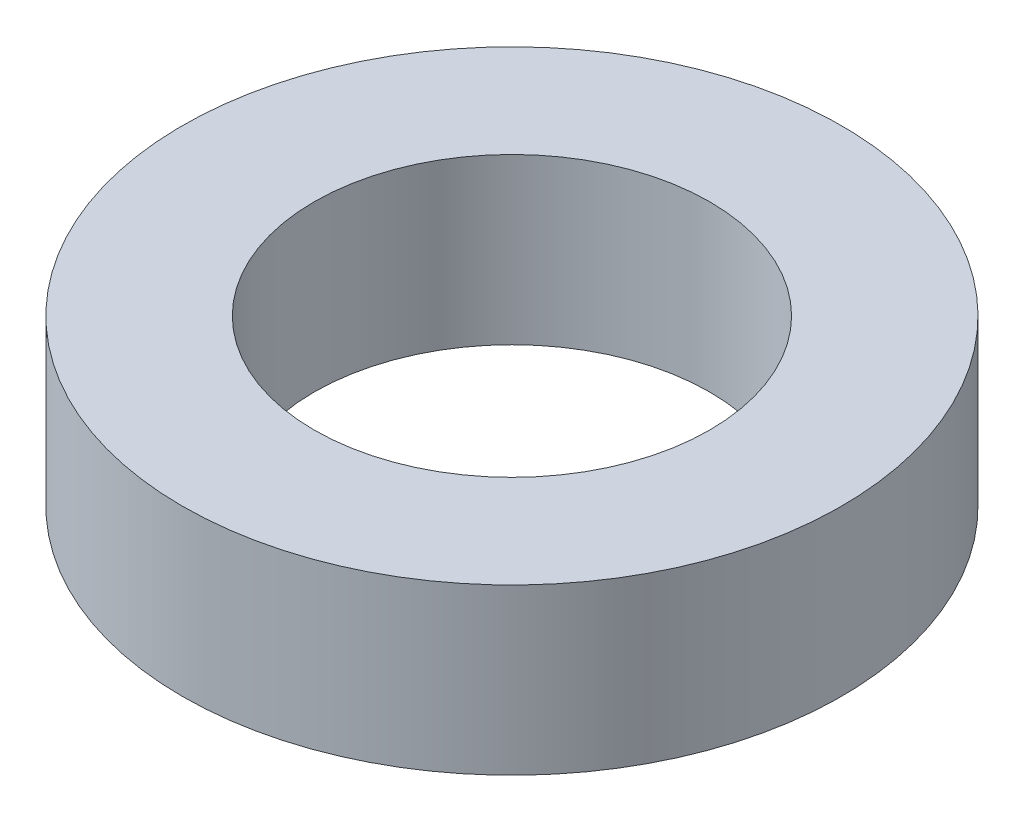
from build123d import *

# Parameters (mm, degrees)
ESQUISSE1_R      = 40
ESQUISSE1_R_2    = 24
EXTRUSION1_DEPTH = 20


with BuildPart() as part:
    # Esquisse1 → Extrusion1 (new body)
    with BuildSketch(Plane(origin=(0, 0, 0), x_dir=(1, 0, 0), z_dir=(0, 1, 0))):
        with Locations(Location((0, 0, 0), (0, 0, 270))):
            Circle(ESQUISSE1_R)
        with Locations(Location((0, 0, 0), (0, 0, 270))):
            Circle(ESQUISSE1_R_2, mode=Mode.SUBTRACT)
    extrude(amount=EXTRUSION1_DEPTH)


solid = part.part
